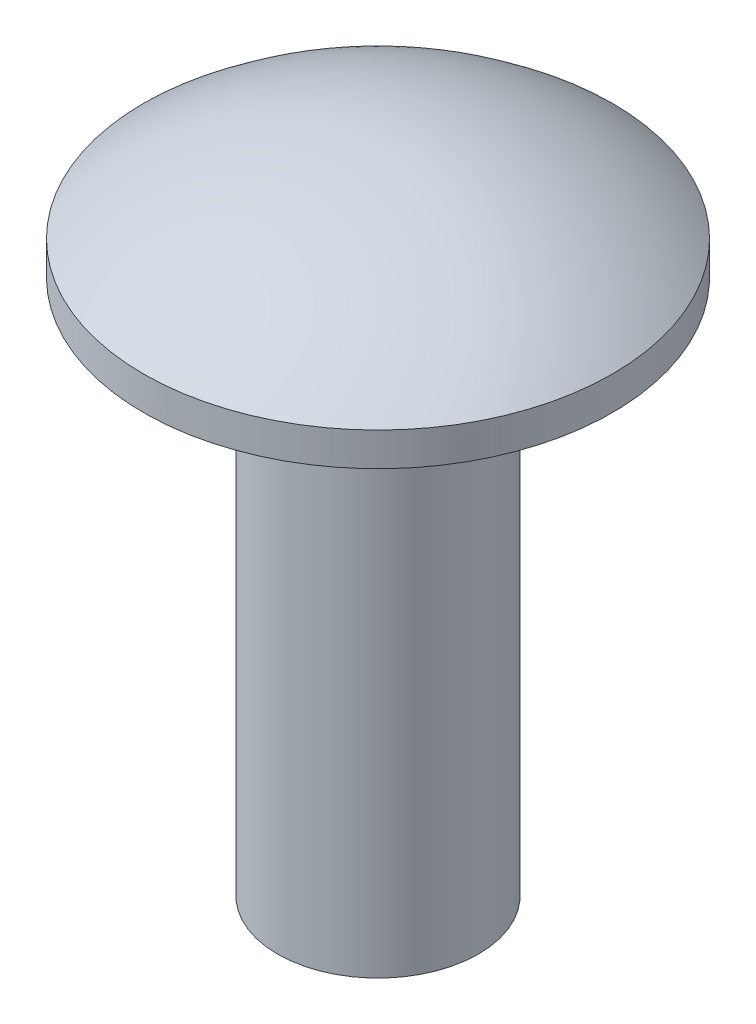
ISO-10303-21;
HEADER;
FILE_DESCRIPTION(('STEP AP214'),'2;1');
FILE_NAME('part.step','',(''),(''),'','','');
FILE_SCHEMA(('AUTOMOTIVE_DESIGN { 1 0 10303 214 1 1 1 1 }'));
ENDSEC;
DATA;
#1=APPLICATION_CONTEXT('core data for automotive mechanical design processes');
#2=APPLICATION_PROTOCOL_DEFINITION('international standard','automotive_design',2000,#1);
#3=PRODUCT_CONTEXT('',#1,'mechanical');
#4=PRODUCT('Part','Part','',(#3));
#5=PRODUCT_RELATED_PRODUCT_CATEGORY('part','',(#4));
#6=PRODUCT_DEFINITION_FORMATION('','',#4);
#7=PRODUCT_DEFINITION_CONTEXT('part definition',#1,'design');
#8=PRODUCT_DEFINITION('design','',#6,#7);
#9=PRODUCT_DEFINITION_SHAPE('','',#8);
#10=(LENGTH_UNIT() NAMED_UNIT(*) SI_UNIT(.MILLI.,.METRE.));
#11=(NAMED_UNIT(*) PLANE_ANGLE_UNIT() SI_UNIT($,.RADIAN.));
#12=(NAMED_UNIT(*) SI_UNIT($,.STERADIAN.) SOLID_ANGLE_UNIT());
#13=UNCERTAINTY_MEASURE_WITH_UNIT(LENGTH_MEASURE(1.E-05),#10,'distance_accuracy_value','');
#14=(GEOMETRIC_REPRESENTATION_CONTEXT(3) GLOBAL_UNCERTAINTY_ASSIGNED_CONTEXT((#13)) GLOBAL_UNIT_ASSIGNED_CONTEXT((#10,
#11,#12)) REPRESENTATION_CONTEXT('',''));
#15=CARTESIAN_POINT('',(0.,0.,0.));
#16=DIRECTION('',(0.,0.,1.));
#17=DIRECTION('',(1.,0.,0.));
#18=AXIS2_PLACEMENT_3D('',#15,#16,#17);
#19=CARTESIAN_POINT('',(3.05,0.,3.05));
#20=DIRECTION('',(0.,1.,0.));
#21=DIRECTION('',(0.,0.,1.));
#22=AXIS2_PLACEMENT_3D('',#19,#20,#21);
#23=PLANE('',#22);
#24=DIRECTION('',(1.,0.,0.));
#25=VECTOR('',#24,1.);
#26=CARTESIAN_POINT('',(3.05,0.,-3.05));
#27=LINE('',#26,#25);
#28=CARTESIAN_POINT('',(-3.05,0.,-3.05));
#29=VERTEX_POINT('',#28);
#30=CARTESIAN_POINT('',(3.05,0.,-3.05));
#31=VERTEX_POINT('',#30);
#32=EDGE_CURVE('E69',#29,#31,#27,.T.);
#33=ORIENTED_EDGE('',*,*,#32,.T.);
#34=DIRECTION('',(0.,0.,-1.));
#35=VECTOR('',#34,1.);
#36=CARTESIAN_POINT('',(3.05,0.,3.05));
#37=LINE('',#36,#35);
#38=CARTESIAN_POINT('',(3.05,0.,3.05));
#39=VERTEX_POINT('',#38);
#40=EDGE_CURVE('E110',#39,#31,#37,.T.);
#41=ORIENTED_EDGE('',*,*,#40,.F.);
#42=DIRECTION('',(1.,0.,0.));
#43=VECTOR('',#42,1.);
#44=CARTESIAN_POINT('',(3.05,0.,3.05));
#45=LINE('',#44,#43);
#46=CARTESIAN_POINT('',(-3.05,0.,3.05));
#47=VERTEX_POINT('',#46);
#48=EDGE_CURVE('E81',#47,#39,#45,.T.);
#49=ORIENTED_EDGE('',*,*,#48,.F.);
#50=DIRECTION('',(0.,0.,-1.));
#51=VECTOR('',#50,1.);
#52=CARTESIAN_POINT('',(-3.05,0.,3.05));
#53=LINE('',#52,#51);
#54=EDGE_CURVE('E47',#47,#29,#53,.T.);
#55=ORIENTED_EDGE('',*,*,#54,.T.);
#56=EDGE_LOOP('',(#33,#41,#49,#55));
#57=FACE_BOUND('',#56,.T.);
#58=CARTESIAN_POINT('',(0.,0.,0.));
#59=DIRECTION('',(0.,1.,0.));
#60=DIRECTION('',(0.,0.,1.));
#61=AXIS2_PLACEMENT_3D('',#58,#59,#60);
#62=CIRCLE('',#61,3.);
#63=CARTESIAN_POINT('',(0.,0.,3.));
#64=VERTEX_POINT('',#63);
#65=EDGE_CURVE('E11',#64,#64,#62,.F.);
#66=ORIENTED_EDGE('',*,*,#65,.F.);
#67=EDGE_LOOP('',(#66));
#68=FACE_BOUND('',#67,.T.);
#69=ADVANCED_FACE('F38',(#57,#68),#23,.F.);
#70=CARTESIAN_POINT('',(-3.05,0.,3.05));
#71=DIRECTION('',(1.,0.,0.));
#72=DIRECTION('',(0.,0.,-1.));
#73=AXIS2_PLACEMENT_3D('',#70,#71,#72);
#74=PLANE('',#73);
#75=DIRECTION('',(0.,-1.,0.));
#76=VECTOR('',#75,1.);
#77=CARTESIAN_POINT('',(-3.05,0.,-3.05));
#78=LINE('',#77,#76);
#79=CARTESIAN_POINT('',(-3.05,1.4,-3.05));
#80=VERTEX_POINT('',#79);
#81=EDGE_CURVE('E86',#80,#29,#78,.T.);
#82=ORIENTED_EDGE('',*,*,#81,.T.);
#83=ORIENTED_EDGE('',*,*,#54,.F.);
#84=DIRECTION('',(0.,-1.,0.));
#85=VECTOR('',#84,1.);
#86=CARTESIAN_POINT('',(-3.05,0.,3.05));
#87=LINE('',#86,#85);
#88=CARTESIAN_POINT('',(-3.05,1.4,3.05));
#89=VERTEX_POINT('',#88);
#90=EDGE_CURVE('E98',#89,#47,#87,.T.);
#91=ORIENTED_EDGE('',*,*,#90,.F.);
#92=DIRECTION('',(0.,0.,-1.));
#93=VECTOR('',#92,1.);
#94=CARTESIAN_POINT('',(-3.05,1.4,3.05));
#95=LINE('',#94,#93);
#96=EDGE_CURVE('E97',#89,#80,#95,.T.);
#97=ORIENTED_EDGE('',*,*,#96,.T.);
#98=EDGE_LOOP('',(#82,#83,#91,#97));
#99=FACE_BOUND('',#98,.T.);
#100=ADVANCED_FACE('F40',(#99),#74,.F.);
#101=CARTESIAN_POINT('',(3.05,0.,3.05));
#102=DIRECTION('',(-1.,0.,0.));
#103=DIRECTION('',(0.,0.,1.));
#104=AXIS2_PLACEMENT_3D('',#101,#102,#103);
#105=PLANE('',#104);
#106=DIRECTION('',(0.,1.,0.));
#107=VECTOR('',#106,1.);
#108=CARTESIAN_POINT('',(3.05,0.,-3.05));
#109=LINE('',#108,#107);
#110=CARTESIAN_POINT('',(3.05,1.4,-3.05));
#111=VERTEX_POINT('',#110);
#112=EDGE_CURVE('E76',#31,#111,#109,.T.);
#113=ORIENTED_EDGE('',*,*,#112,.T.);
#114=DIRECTION('',(0.,0.,-1.));
#115=VECTOR('',#114,1.);
#116=CARTESIAN_POINT('',(3.05,1.4,3.05));
#117=LINE('',#116,#115);
#118=CARTESIAN_POINT('',(3.05,1.4,3.05));
#119=VERTEX_POINT('',#118);
#120=EDGE_CURVE('E100',#119,#111,#117,.T.);
#121=ORIENTED_EDGE('',*,*,#120,.F.);
#122=DIRECTION('',(0.,1.,0.));
#123=VECTOR('',#122,1.);
#124=CARTESIAN_POINT('',(3.05,0.,3.05));
#125=LINE('',#124,#123);
#126=EDGE_CURVE('E206',#39,#119,#125,.T.);
#127=ORIENTED_EDGE('',*,*,#126,.F.);
#128=ORIENTED_EDGE('',*,*,#40,.T.);
#129=EDGE_LOOP('',(#113,#121,#127,#128));
#130=FACE_BOUND('',#129,.T.);
#131=ADVANCED_FACE('F140',(#130),#105,.F.);
#132=CARTESIAN_POINT('',(-3.05,1.4,3.05));
#133=DIRECTION('',(0.,0.,1.));
#134=DIRECTION('',(1.,0.,0.));
#135=AXIS2_PLACEMENT_3D('',#132,#133,#134);
#136=PLANE('',#135);
#137=ORIENTED_EDGE('',*,*,#90,.T.);
#138=ORIENTED_EDGE('',*,*,#48,.T.);
#139=ORIENTED_EDGE('',*,*,#126,.T.);
#140=DIRECTION('',(-1.,0.,0.));
#141=VECTOR('',#140,1.);
#142=CARTESIAN_POINT('',(3.05,1.4,3.05));
#143=LINE('',#142,#141);
#144=EDGE_CURVE('E55',#119,#89,#143,.T.);
#145=ORIENTED_EDGE('',*,*,#144,.T.);
#146=EDGE_LOOP('',(#137,#138,#139,#145));
#147=FACE_BOUND('',#146,.T.);
#148=ADVANCED_FACE('F137',(#147),#136,.T.);
#149=CARTESIAN_POINT('',(-3.05,1.4,-3.05));
#150=DIRECTION('',(0.,0.,1.));
#151=DIRECTION('',(1.,0.,0.));
#152=AXIS2_PLACEMENT_3D('',#149,#150,#151);
#153=PLANE('',#152);
#154=ORIENTED_EDGE('',*,*,#81,.F.);
#155=DIRECTION('',(-1.,0.,0.));
#156=VECTOR('',#155,1.);
#157=CARTESIAN_POINT('',(3.05,1.4,-3.05));
#158=LINE('',#157,#156);
#159=EDGE_CURVE('E90',#111,#80,#158,.T.);
#160=ORIENTED_EDGE('',*,*,#159,.F.);
#161=ORIENTED_EDGE('',*,*,#112,.F.);
#162=ORIENTED_EDGE('',*,*,#32,.F.);
#163=EDGE_LOOP('',(#154,#160,#161,#162));
#164=FACE_BOUND('',#163,.T.);
#165=ADVANCED_FACE('F88',(#164),#153,.F.);
#166=CARTESIAN_POINT('',(0.,13.6764082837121,0.));
#167=DIRECTION('',(0.,1.,0.));
#168=DIRECTION('',(-1.,0.,0.));
#169=AXIS2_PLACEMENT_3D('',#166,#167,#168);
#170=CYLINDRICAL_SURFACE('',#169,7.);
#171=CARTESIAN_POINT('',(0.,2.4,0.));
#172=DIRECTION('',(0.,1.,0.));
#173=DIRECTION('',(-1.,0.,0.));
#174=AXIS2_PLACEMENT_3D('',#171,#172,#173);
#175=CIRCLE('',#174,7.);
#176=CARTESIAN_POINT('',(-7.,2.40000000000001,0.));
#177=VERTEX_POINT('',#176);
#178=EDGE_CURVE('E94',#177,#177,#175,.T.);
#179=ORIENTED_EDGE('',*,*,#178,.F.);
#180=EDGE_LOOP('',(#179));
#181=FACE_BOUND('',#180,.T.);
#182=CARTESIAN_POINT('',(0.,1.40000000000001,0.));
#183=DIRECTION('',(0.,1.,0.));
#184=DIRECTION('',(-1.,0.,0.));
#185=AXIS2_PLACEMENT_3D('',#182,#183,#184);
#186=CIRCLE('',#185,7.);
#187=CARTESIAN_POINT('',(-7.,1.40000000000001,0.));
#188=VERTEX_POINT('',#187);
#189=EDGE_CURVE('E213',#188,#188,#186,.T.);
#190=ORIENTED_EDGE('',*,*,#189,.T.);
#191=EDGE_LOOP('',(#190));
#192=FACE_BOUND('',#191,.T.);
#193=ADVANCED_FACE('F132',(#181,#192),#170,.T.);
#194=CARTESIAN_POINT('',(0.,-6.15,0.));
#195=DIRECTION('',(0.,1.,0.));
#196=DIRECTION('',(1.,0.,0.));
#197=AXIS2_PLACEMENT_3D('',#194,#195,#196);
#198=SPHERICAL_SURFACE('',#197,11.05);
#199=ORIENTED_EDGE('',*,*,#178,.T.);
#200=EDGE_LOOP('',(#199));
#201=FACE_BOUND('',#200,.T.);
#202=ADVANCED_FACE('F126',(#201),#198,.T.);
#203=CARTESIAN_POINT('',(0.,1.4,0.));
#204=DIRECTION('',(0.,1.,0.));
#205=DIRECTION('',(-1.,0.,0.));
#206=AXIS2_PLACEMENT_3D('',#203,#204,#205);
#207=PLANE('',#206);
#208=ORIENTED_EDGE('',*,*,#144,.F.);
#209=ORIENTED_EDGE('',*,*,#120,.T.);
#210=ORIENTED_EDGE('',*,*,#159,.T.);
#211=ORIENTED_EDGE('',*,*,#96,.F.);
#212=EDGE_LOOP('',(#208,#209,#210,#211));
#213=FACE_BOUND('',#212,.T.);
#214=ORIENTED_EDGE('',*,*,#189,.F.);
#215=EDGE_LOOP('',(#214));
#216=FACE_BOUND('',#215,.T.);
#217=ADVANCED_FACE('F102',(#213,#216),#207,.F.);
#218=CARTESIAN_POINT('',(0.,-14.6,0.));
#219=DIRECTION('',(0.,1.,0.));
#220=DIRECTION('',(-1.,0.,0.));
#221=AXIS2_PLACEMENT_3D('',#218,#219,#220);
#222=CYLINDRICAL_SURFACE('',#221,3.);
#223=CARTESIAN_POINT('',(0.,-14.6,0.));
#224=DIRECTION('',(0.,-1.,0.));
#225=DIRECTION('',(1.,0.,0.));
#226=AXIS2_PLACEMENT_3D('',#223,#224,#225);
#227=CIRCLE('',#226,3.);
#228=CARTESIAN_POINT('',(2.99999999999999,-14.6,0.));
#229=VERTEX_POINT('',#228);
#230=EDGE_CURVE('E216',#229,#229,#227,.T.);
#231=ORIENTED_EDGE('',*,*,#230,.F.);
#232=EDGE_LOOP('',(#231));
#233=FACE_BOUND('',#232,.T.);
#234=ORIENTED_EDGE('',*,*,#65,.T.);
#235=EDGE_LOOP('',(#234));
#236=FACE_BOUND('',#235,.T.);
#237=ADVANCED_FACE('F115',(#233,#236),#222,.T.);
#238=CARTESIAN_POINT('',(0.,-14.6,0.));
#239=DIRECTION('',(0.,-1.,0.));
#240=DIRECTION('',(1.,0.,0.));
#241=AXIS2_PLACEMENT_3D('',#238,#239,#240);
#242=PLANE('',#241);
#243=ORIENTED_EDGE('',*,*,#230,.T.);
#244=EDGE_LOOP('',(#243));
#245=FACE_BOUND('',#244,.T.);
#246=ADVANCED_FACE('F117',(#245),#242,.T.);
#247=CLOSED_SHELL('',(#69,#100,#131,#148,#165,#193,#202,#217,#237,#246));
#248=MANIFOLD_SOLID_BREP('B2',#247);
#249=ADVANCED_BREP_SHAPE_REPRESENTATION('',(#18,#248),#14);
#250=SHAPE_DEFINITION_REPRESENTATION(#9,#249);
ENDSEC;
END-ISO-10303-21;
